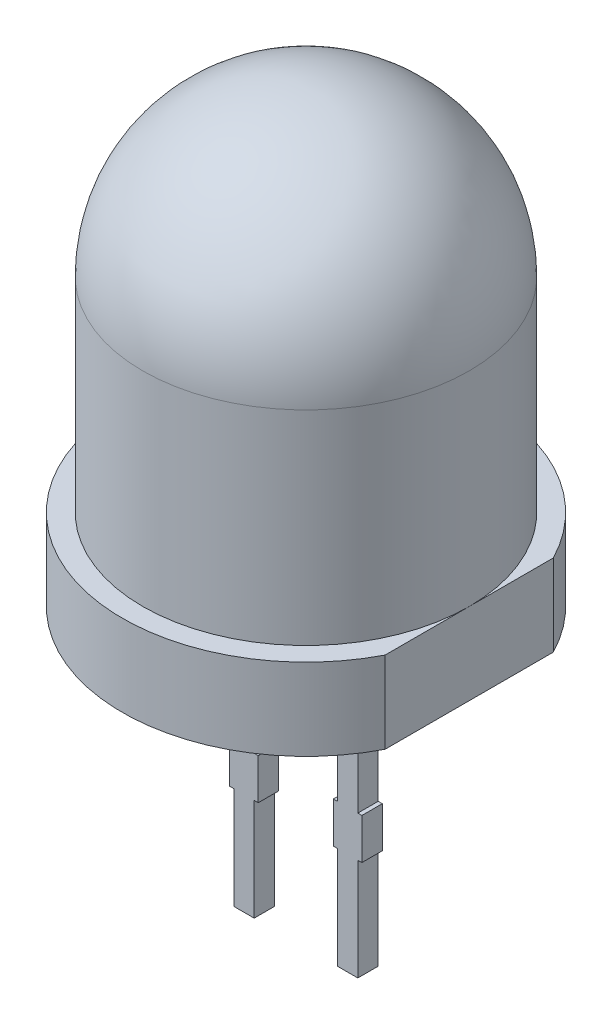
from build123d import *

# Parameters (mm, degrees)
CUT_EXTRUDE_2_REACH = 13.023
EXTRUDE_1_DEPTH     = 0.25


with BuildPart() as part:
    # Sketch 1 → Revolve 1 (revolve)
    with BuildSketch(Plane.XY, mode=Mode.PRIVATE) as revolve_1_sk:
        with BuildLine():
            Line((4, 11.5), (4, 6.5))
            Line((4, 6.5), (4.5, 6.5))
            Line((4.5, 6.5), (4.5, 4.5))
            Line((4.5, 4.5), (0, 4.5))
            Line((0, 4.5), (0, 15.5))
            ThreePointArc((0, 15.5), (2.828427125, 14.328427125), (4, 11.5))
        make_face()
    revolve(revolve_1_sk.sketch.rotate(Axis((0, 4.5, 0), (0, 1, 0)), 90), axis=Axis((0, 4.5, 0), (0, 1, 0)))

    # Sketch 3 → Cut-Extrude 2 (cut, up to next)
    with BuildSketch(Plane(origin=(0, 6.5, 0), x_dir=(1, 0, 0), z_dir=(0, 1, 0)), mode=Mode.PRIVATE) as cut_extrude_2_sk1:
        with BuildLine():
            Line((4, 2.061552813), (4, -2.061552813))
            ThreePointArc((4, -2.061552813), (4.5, 0), (4, 2.061552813))
        make_face()
    cut_extrude_2_tool1 = extrude(cut_extrude_2_sk1.sketch, amount=-CUT_EXTRUDE_2_REACH, mode=Mode.PRIVATE) & part.part
    add(cut_extrude_2_tool1.solids().sort_by_distance((4.200984, 6.5, 0))[0], mode=Mode.SUBTRACT)

    # Sketch 2 → Extrude 1 (add, symmetric)
    with BuildSketch(Plane.XY):
        Polygon((-1.52, 4.5), (-1.52, 1), (-1.62, 1), (-1.62, 0), (-1.52, 0), (-1.52, -2.5), (-1.02, -2.5), (-1.02, 0), (-0.92, 0), (-0.92, 1), (-1.02, 1), (-1.02, 4.5), align=None)
        Polygon((1.02, 4.5), (1.02, 1), (0.92, 1), (0.92, 0), (1.02, 0), (1.02, -2.5), (1.52, -2.5), (1.52, 0), (1.62, 0), (1.62, 1), (1.52, 1), (1.52, 4.5), align=None)
    extrude(amount=EXTRUDE_1_DEPTH, both=True)


solid = part.part
